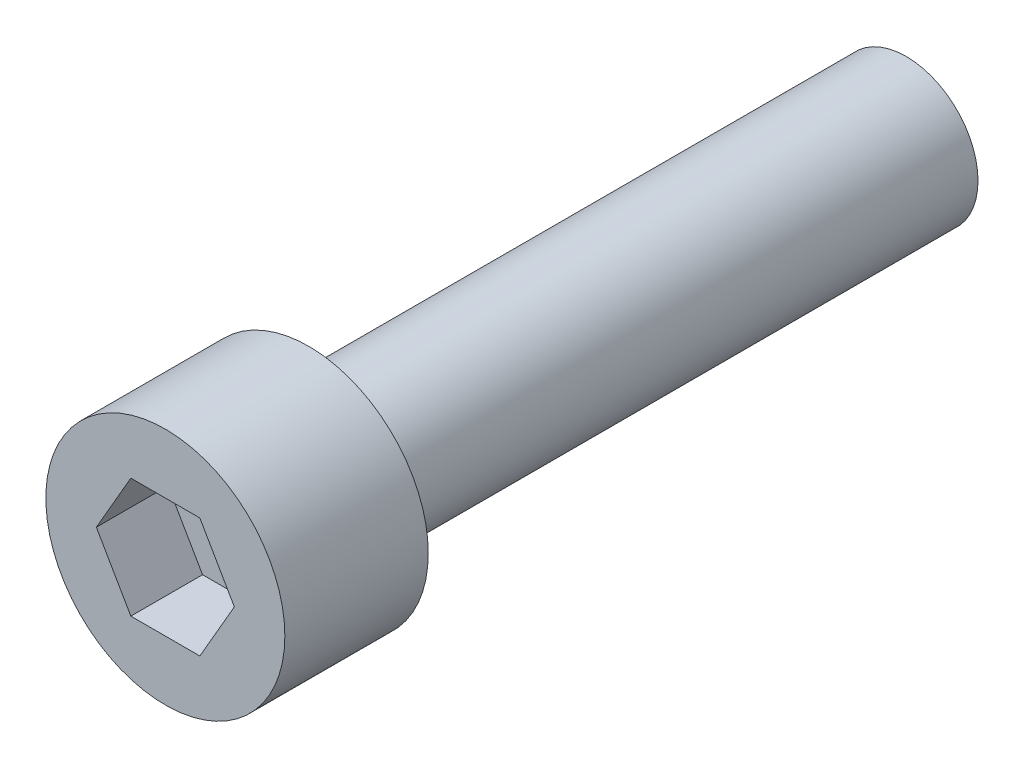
ISO-10303-21;
HEADER;
FILE_DESCRIPTION(('STEP AP214'),'2;1');
FILE_NAME('part.step','',(''),(''),'','','');
FILE_SCHEMA(('AUTOMOTIVE_DESIGN { 1 0 10303 214 1 1 1 1 }'));
ENDSEC;
DATA;
#1=APPLICATION_CONTEXT('core data for automotive mechanical design processes');
#2=APPLICATION_PROTOCOL_DEFINITION('international standard','automotive_design',2000,#1);
#3=PRODUCT_CONTEXT('',#1,'mechanical');
#4=PRODUCT('Part','Part','',(#3));
#5=PRODUCT_RELATED_PRODUCT_CATEGORY('part','',(#4));
#6=PRODUCT_DEFINITION_FORMATION('','',#4);
#7=PRODUCT_DEFINITION_CONTEXT('part definition',#1,'design');
#8=PRODUCT_DEFINITION('design','',#6,#7);
#9=PRODUCT_DEFINITION_SHAPE('','',#8);
#10=(LENGTH_UNIT() NAMED_UNIT(*) SI_UNIT(.MILLI.,.METRE.));
#11=(NAMED_UNIT(*) PLANE_ANGLE_UNIT() SI_UNIT($,.RADIAN.));
#12=(NAMED_UNIT(*) SI_UNIT($,.STERADIAN.) SOLID_ANGLE_UNIT());
#13=UNCERTAINTY_MEASURE_WITH_UNIT(LENGTH_MEASURE(1.E-05),#10,'distance_accuracy_value','');
#14=(GEOMETRIC_REPRESENTATION_CONTEXT(3) GLOBAL_UNCERTAINTY_ASSIGNED_CONTEXT((#13)) GLOBAL_UNIT_ASSIGNED_CONTEXT((#10,
#11,#12)) REPRESENTATION_CONTEXT('',''));
#15=CARTESIAN_POINT('',(0.,0.,0.));
#16=DIRECTION('',(0.,0.,1.));
#17=DIRECTION('',(1.,0.,0.));
#18=AXIS2_PLACEMENT_3D('',#15,#16,#17);
#19=CARTESIAN_POINT('',(0.,0.,0.));
#20=DIRECTION('',(0.,0.,1.));
#21=DIRECTION('',(1.,0.,0.));
#22=AXIS2_PLACEMENT_3D('',#19,#20,#21);
#23=PLANE('',#22);
#24=CARTESIAN_POINT('',(0.,0.,0.));
#25=DIRECTION('',(0.,0.,1.));
#26=DIRECTION('',(1.,0.,0.));
#27=AXIS2_PLACEMENT_3D('',#24,#25,#26);
#28=CIRCLE('',#27,5.);
#29=CARTESIAN_POINT('',(5.,0.,0.));
#30=VERTEX_POINT('',#29);
#31=EDGE_CURVE('E127',#30,#30,#28,.T.);
#32=ORIENTED_EDGE('',*,*,#31,.F.);
#33=EDGE_LOOP('',(#32));
#34=FACE_BOUND('',#33,.T.);
#35=CARTESIAN_POINT('',(0.,0.,0.));
#36=DIRECTION('',(0.,0.,1.));
#37=DIRECTION('',(1.,0.,0.));
#38=AXIS2_PLACEMENT_3D('',#35,#36,#37);
#39=CIRCLE('',#38,3.);
#40=CARTESIAN_POINT('',(3.,0.,0.));
#41=VERTEX_POINT('',#40);
#42=EDGE_CURVE('E11',#41,#41,#39,.F.);
#43=ORIENTED_EDGE('',*,*,#42,.F.);
#44=EDGE_LOOP('',(#43));
#45=FACE_BOUND('',#44,.T.);
#46=ADVANCED_FACE('F17',(#34,#45),#23,.F.);
#47=CARTESIAN_POINT('',(0.,0.,6.));
#48=DIRECTION('',(0.,0.,-1.));
#49=DIRECTION('',(-1.,0.,0.));
#50=AXIS2_PLACEMENT_3D('',#47,#48,#49);
#51=CYLINDRICAL_SURFACE('',#50,5.);
#52=CARTESIAN_POINT('',(0.,0.,6.));
#53=DIRECTION('',(0.,0.,1.));
#54=DIRECTION('',(1.,0.,0.));
#55=AXIS2_PLACEMENT_3D('',#52,#53,#54);
#56=CIRCLE('',#55,5.);
#57=CARTESIAN_POINT('',(5.,0.,6.));
#58=VERTEX_POINT('',#57);
#59=EDGE_CURVE('E25',#58,#58,#56,.T.);
#60=ORIENTED_EDGE('',*,*,#59,.F.);
#61=EDGE_LOOP('',(#60));
#62=FACE_BOUND('',#61,.T.);
#63=ORIENTED_EDGE('',*,*,#31,.T.);
#64=EDGE_LOOP('',(#63));
#65=FACE_BOUND('',#64,.T.);
#66=ADVANCED_FACE('F19',(#62,#65),#51,.T.);
#67=CARTESIAN_POINT('',(0.,0.,6.));
#68=DIRECTION('',(0.,0.,1.));
#69=DIRECTION('',(1.,0.,0.));
#70=AXIS2_PLACEMENT_3D('',#67,#68,#69);
#71=PLANE('',#70);
#72=DIRECTION('',(0.50000000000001,0.866025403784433,0.));
#73=VECTOR('',#72,1.);
#74=CARTESIAN_POINT('',(1.44337567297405,-2.5,6.));
#75=LINE('',#74,#73);
#76=CARTESIAN_POINT('',(1.44337567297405,-2.5,6.));
#77=VERTEX_POINT('',#76);
#78=CARTESIAN_POINT('',(2.88675134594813,0.,6.));
#79=VERTEX_POINT('',#78);
#80=EDGE_CURVE('E32',#77,#79,#75,.T.);
#81=ORIENTED_EDGE('',*,*,#80,.F.);
#82=DIRECTION('',(1.,0.,0.));
#83=VECTOR('',#82,1.);
#84=CARTESIAN_POINT('',(-1.44337567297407,-2.5,6.));
#85=LINE('',#84,#83);
#86=CARTESIAN_POINT('',(-1.44337567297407,-2.5,6.));
#87=VERTEX_POINT('',#86);
#88=EDGE_CURVE('E115',#87,#77,#85,.T.);
#89=ORIENTED_EDGE('',*,*,#88,.F.);
#90=DIRECTION('',(0.5,-0.86602540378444,0.));
#91=VECTOR('',#90,1.);
#92=CARTESIAN_POINT('',(-2.88675134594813,0.,6.));
#93=LINE('',#92,#91);
#94=CARTESIAN_POINT('',(-2.88675134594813,0.,6.));
#95=VERTEX_POINT('',#94);
#96=EDGE_CURVE('E113',#95,#87,#93,.T.);
#97=ORIENTED_EDGE('',*,*,#96,.F.);
#98=DIRECTION('',(-0.5,-0.866025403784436,0.));
#99=VECTOR('',#98,1.);
#100=CARTESIAN_POINT('',(-1.44337567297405,2.5,6.));
#101=LINE('',#100,#99);
#102=CARTESIAN_POINT('',(-1.44337567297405,2.5,6.));
#103=VERTEX_POINT('',#102);
#104=EDGE_CURVE('E80',#103,#95,#101,.T.);
#105=ORIENTED_EDGE('',*,*,#104,.F.);
#106=DIRECTION('',(-1.,0.,0.));
#107=VECTOR('',#106,1.);
#108=CARTESIAN_POINT('',(1.44337567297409,2.5,6.));
#109=LINE('',#108,#107);
#110=CARTESIAN_POINT('',(1.44337567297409,2.5,6.));
#111=VERTEX_POINT('',#110);
#112=EDGE_CURVE('E109',#111,#103,#109,.T.);
#113=ORIENTED_EDGE('',*,*,#112,.F.);
#114=DIRECTION('',(-0.499999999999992,0.866025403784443,0.));
#115=VECTOR('',#114,1.);
#116=CARTESIAN_POINT('',(2.88675134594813,0.,6.));
#117=LINE('',#116,#115);
#118=EDGE_CURVE('E106',#79,#111,#117,.T.);
#119=ORIENTED_EDGE('',*,*,#118,.F.);
#120=EDGE_LOOP('',(#81,#89,#97,#105,#113,#119));
#121=FACE_BOUND('',#120,.T.);
#122=ORIENTED_EDGE('',*,*,#59,.T.);
#123=EDGE_LOOP('',(#122));
#124=FACE_BOUND('',#123,.T.);
#125=ADVANCED_FACE('F140',(#121,#124),#71,.T.);
#126=CARTESIAN_POINT('',(0.,0.,-25.));
#127=DIRECTION('',(0.,0.,1.));
#128=DIRECTION('',(1.,0.,0.));
#129=AXIS2_PLACEMENT_3D('',#126,#127,#128);
#130=CYLINDRICAL_SURFACE('',#129,3.);
#131=CARTESIAN_POINT('',(0.,0.,-25.));
#132=DIRECTION('',(0.,0.,-1.));
#133=DIRECTION('',(-1.,0.,0.));
#134=AXIS2_PLACEMENT_3D('',#131,#132,#133);
#135=CIRCLE('',#134,3.);
#136=CARTESIAN_POINT('',(-3.,0.,-25.));
#137=VERTEX_POINT('',#136);
#138=EDGE_CURVE('E119',#137,#137,#135,.T.);
#139=ORIENTED_EDGE('',*,*,#138,.F.);
#140=EDGE_LOOP('',(#139));
#141=FACE_BOUND('',#140,.T.);
#142=ORIENTED_EDGE('',*,*,#42,.T.);
#143=EDGE_LOOP('',(#142));
#144=FACE_BOUND('',#143,.T.);
#145=ADVANCED_FACE('F137',(#141,#144),#130,.T.);
#146=CARTESIAN_POINT('',(0.,0.,-25.));
#147=DIRECTION('',(0.,0.,-1.));
#148=DIRECTION('',(-1.,0.,0.));
#149=AXIS2_PLACEMENT_3D('',#146,#147,#148);
#150=PLANE('',#149);
#151=ORIENTED_EDGE('',*,*,#138,.T.);
#152=EDGE_LOOP('',(#151));
#153=FACE_BOUND('',#152,.T.);
#154=ADVANCED_FACE('F139',(#153),#150,.T.);
#155=CARTESIAN_POINT('',(1.44337567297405,-2.5,3.));
#156=DIRECTION('',(0.866025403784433,-0.50000000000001,0.));
#157=DIRECTION('',(0.50000000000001,0.866025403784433,0.));
#158=AXIS2_PLACEMENT_3D('',#155,#156,#157);
#159=PLANE('',#158);
#160=ORIENTED_EDGE('',*,*,#80,.T.);
#161=DIRECTION('',(0.,0.,1.));
#162=VECTOR('',#161,1.);
#163=CARTESIAN_POINT('',(2.88675134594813,0.,3.));
#164=LINE('',#163,#162);
#165=CARTESIAN_POINT('',(2.88675134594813,0.,3.));
#166=VERTEX_POINT('',#165);
#167=EDGE_CURVE('E62',#166,#79,#164,.T.);
#168=ORIENTED_EDGE('',*,*,#167,.F.);
#169=DIRECTION('',(0.50000000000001,0.866025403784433,0.));
#170=VECTOR('',#169,1.);
#171=CARTESIAN_POINT('',(1.44337567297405,-2.5,3.));
#172=LINE('',#171,#170);
#173=CARTESIAN_POINT('',(1.44337567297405,-2.5,3.));
#174=VERTEX_POINT('',#173);
#175=EDGE_CURVE('E117',#174,#166,#172,.T.);
#176=ORIENTED_EDGE('',*,*,#175,.F.);
#177=DIRECTION('',(0.,0.,1.));
#178=VECTOR('',#177,1.);
#179=CARTESIAN_POINT('',(1.44337567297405,-2.5,3.));
#180=LINE('',#179,#178);
#181=EDGE_CURVE('E40',#174,#77,#180,.T.);
#182=ORIENTED_EDGE('',*,*,#181,.T.);
#183=EDGE_LOOP('',(#160,#168,#176,#182));
#184=FACE_BOUND('',#183,.T.);
#185=ADVANCED_FACE('F149',(#184),#159,.F.);
#186=CARTESIAN_POINT('',(-1.44337567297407,-2.5,3.));
#187=DIRECTION('',(0.,-1.,0.));
#188=DIRECTION('',(1.,0.,0.));
#189=AXIS2_PLACEMENT_3D('',#186,#187,#188);
#190=PLANE('',#189);
#191=ORIENTED_EDGE('',*,*,#88,.T.);
#192=ORIENTED_EDGE('',*,*,#181,.F.);
#193=DIRECTION('',(1.,0.,0.));
#194=VECTOR('',#193,1.);
#195=CARTESIAN_POINT('',(-1.44337567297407,-2.5,3.));
#196=LINE('',#195,#194);
#197=CARTESIAN_POINT('',(-1.44337567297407,-2.5,3.));
#198=VERTEX_POINT('',#197);
#199=EDGE_CURVE('E92',#198,#174,#196,.T.);
#200=ORIENTED_EDGE('',*,*,#199,.F.);
#201=DIRECTION('',(0.,0.,1.));
#202=VECTOR('',#201,1.);
#203=CARTESIAN_POINT('',(-1.44337567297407,-2.5,3.));
#204=LINE('',#203,#202);
#205=EDGE_CURVE('E84',#198,#87,#204,.T.);
#206=ORIENTED_EDGE('',*,*,#205,.T.);
#207=EDGE_LOOP('',(#191,#192,#200,#206));
#208=FACE_BOUND('',#207,.T.);
#209=ADVANCED_FACE('F158',(#208),#190,.F.);
#210=CARTESIAN_POINT('',(-2.88675134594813,0.,3.));
#211=DIRECTION('',(-0.86602540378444,-0.5,0.));
#212=DIRECTION('',(0.5,-0.86602540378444,0.));
#213=AXIS2_PLACEMENT_3D('',#210,#211,#212);
#214=PLANE('',#213);
#215=ORIENTED_EDGE('',*,*,#96,.T.);
#216=ORIENTED_EDGE('',*,*,#205,.F.);
#217=DIRECTION('',(0.5,-0.86602540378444,0.));
#218=VECTOR('',#217,1.);
#219=CARTESIAN_POINT('',(-2.88675134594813,0.,3.));
#220=LINE('',#219,#218);
#221=CARTESIAN_POINT('',(-2.88675134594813,0.,3.));
#222=VERTEX_POINT('',#221);
#223=EDGE_CURVE('E88',#222,#198,#220,.T.);
#224=ORIENTED_EDGE('',*,*,#223,.F.);
#225=DIRECTION('',(0.,0.,1.));
#226=VECTOR('',#225,1.);
#227=CARTESIAN_POINT('',(-2.88675134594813,0.,3.));
#228=LINE('',#227,#226);
#229=EDGE_CURVE('E73',#222,#95,#228,.T.);
#230=ORIENTED_EDGE('',*,*,#229,.T.);
#231=EDGE_LOOP('',(#215,#216,#224,#230));
#232=FACE_BOUND('',#231,.T.);
#233=ADVANCED_FACE('F89',(#232),#214,.F.);
#234=CARTESIAN_POINT('',(-1.44337567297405,2.5,3.));
#235=DIRECTION('',(-0.866025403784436,0.5,0.));
#236=DIRECTION('',(-0.5,-0.866025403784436,0.));
#237=AXIS2_PLACEMENT_3D('',#234,#235,#236);
#238=PLANE('',#237);
#239=ORIENTED_EDGE('',*,*,#104,.T.);
#240=ORIENTED_EDGE('',*,*,#229,.F.);
#241=DIRECTION('',(-0.5,-0.866025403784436,0.));
#242=VECTOR('',#241,1.);
#243=CARTESIAN_POINT('',(-1.44337567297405,2.5,3.));
#244=LINE('',#243,#242);
#245=CARTESIAN_POINT('',(-1.44337567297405,2.5,3.));
#246=VERTEX_POINT('',#245);
#247=EDGE_CURVE('E77',#246,#222,#244,.T.);
#248=ORIENTED_EDGE('',*,*,#247,.F.);
#249=DIRECTION('',(0.,0.,1.));
#250=VECTOR('',#249,1.);
#251=CARTESIAN_POINT('',(-1.44337567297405,2.5,3.));
#252=LINE('',#251,#250);
#253=EDGE_CURVE('E85',#246,#103,#252,.T.);
#254=ORIENTED_EDGE('',*,*,#253,.T.);
#255=EDGE_LOOP('',(#239,#240,#248,#254));
#256=FACE_BOUND('',#255,.T.);
#257=ADVANCED_FACE('F75',(#256),#238,.F.);
#258=CARTESIAN_POINT('',(1.44337567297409,2.5,3.));
#259=DIRECTION('',(0.,1.,0.));
#260=DIRECTION('',(-1.,0.,0.));
#261=AXIS2_PLACEMENT_3D('',#258,#259,#260);
#262=PLANE('',#261);
#263=ORIENTED_EDGE('',*,*,#112,.T.);
#264=ORIENTED_EDGE('',*,*,#253,.F.);
#265=DIRECTION('',(-1.,0.,0.));
#266=VECTOR('',#265,1.);
#267=CARTESIAN_POINT('',(1.44337567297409,2.5,3.));
#268=LINE('',#267,#266);
#269=CARTESIAN_POINT('',(1.44337567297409,2.5,3.));
#270=VERTEX_POINT('',#269);
#271=EDGE_CURVE('E98',#270,#246,#268,.T.);
#272=ORIENTED_EDGE('',*,*,#271,.F.);
#273=DIRECTION('',(0.,0.,1.));
#274=VECTOR('',#273,1.);
#275=CARTESIAN_POINT('',(1.44337567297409,2.5,3.));
#276=LINE('',#275,#274);
#277=EDGE_CURVE('E122',#270,#111,#276,.T.);
#278=ORIENTED_EDGE('',*,*,#277,.T.);
#279=EDGE_LOOP('',(#263,#264,#272,#278));
#280=FACE_BOUND('',#279,.T.);
#281=ADVANCED_FACE('F162',(#280),#262,.F.);
#282=CARTESIAN_POINT('',(2.88675134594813,0.,3.));
#283=DIRECTION('',(0.866025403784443,0.499999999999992,0.));
#284=DIRECTION('',(-0.499999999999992,0.866025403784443,0.));
#285=AXIS2_PLACEMENT_3D('',#282,#283,#284);
#286=PLANE('',#285);
#287=ORIENTED_EDGE('',*,*,#118,.T.);
#288=ORIENTED_EDGE('',*,*,#277,.F.);
#289=DIRECTION('',(-0.499999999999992,0.866025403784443,0.));
#290=VECTOR('',#289,1.);
#291=CARTESIAN_POINT('',(2.88675134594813,0.,3.));
#292=LINE('',#291,#290);
#293=EDGE_CURVE('E100',#166,#270,#292,.T.);
#294=ORIENTED_EDGE('',*,*,#293,.F.);
#295=ORIENTED_EDGE('',*,*,#167,.T.);
#296=EDGE_LOOP('',(#287,#288,#294,#295));
#297=FACE_BOUND('',#296,.T.);
#298=ADVANCED_FACE('F159',(#297),#286,.F.);
#299=CARTESIAN_POINT('',(2.88675134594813,0.,3.));
#300=DIRECTION('',(0.,0.,1.));
#301=DIRECTION('',(1.,0.,0.));
#302=AXIS2_PLACEMENT_3D('',#299,#300,#301);
#303=PLANE('',#302);
#304=ORIENTED_EDGE('',*,*,#175,.T.);
#305=ORIENTED_EDGE('',*,*,#293,.T.);
#306=ORIENTED_EDGE('',*,*,#271,.T.);
#307=ORIENTED_EDGE('',*,*,#247,.T.);
#308=ORIENTED_EDGE('',*,*,#223,.T.);
#309=ORIENTED_EDGE('',*,*,#199,.T.);
#310=EDGE_LOOP('',(#304,#305,#306,#307,#308,#309));
#311=FACE_BOUND('',#310,.T.);
#312=ADVANCED_FACE('F95',(#311),#303,.T.);
#313=CLOSED_SHELL('',(#46,#66,#125,#145,#154,#185,#209,#233,#257,#281,#298,#312));
#314=MANIFOLD_SOLID_BREP('B1',#313);
#315=ADVANCED_BREP_SHAPE_REPRESENTATION('',(#18,#314),#14);
#316=SHAPE_DEFINITION_REPRESENTATION(#9,#315);
ENDSEC;
END-ISO-10303-21;
